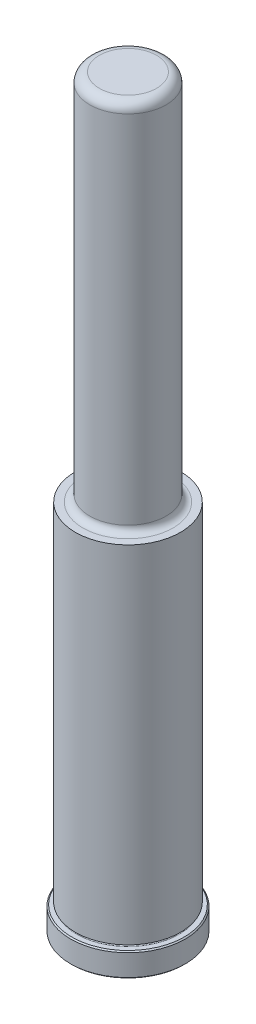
from build123d import *

# Parameters (mm, degrees)
CHAMFER1_SIZE = 0.381
FILLET7_R     = 3.175


with BuildPart() as part:
    # Sketch1 → Revolve1 (revolve)
    with BuildSketch(Plane(origin=(0, 0, 0), x_dir=(0, 0, -1), z_dir=(1, 0, 0)), mode=Mode.PRIVATE) as revolve1_sk:
        with BuildLine():
            Line((0, 0), (19.05, 0))
            Line((19.05, 0), (19.05, 7.9248))
            Line((19.05, 7.9248), (17.0688, 7.9248))
            ThreePointArc((17.0688, 7.9248), (16.6878, 8.3058), (17.0688, 8.6868))
            Line((17.0688, 8.6868), (17.4752, 8.6868))
            Line((17.4752, 8.6868), (17.4752, 123.825))
            Line((17.4752, 123.825), (14.9733, 123.825))
            ThreePointArc((14.9733, 123.825), (13.356853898, 124.494553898), (12.6873, 126.111))
            Line((12.6873, 126.111), (12.6873, 247.65))
            Line((12.6873, 247.65), (0, 247.65))
            Line((0, 247.65), (0, 0))
        make_face()
    revolve(revolve1_sk.sketch.rotate(Axis((0, 0, 0), (0, -1, 0)), 180), axis=Axis((0, 0, 0), (0, -1, 0)))

    # Chamfer1
    chamfer1_edges = [part.edges().sort_by_distance(p)[0] for p in [
        (0, 7.9248, -19.05),
        (0, 0, -19.05),
    ]]
    chamfer(chamfer1_edges, length=CHAMFER1_SIZE)

    # Fillet7
    fillet7_edges = [part.edges().sort_by_distance(p)[0] for p in [
        (0, 247.65, -12.6873),
    ]]
    fillet(fillet7_edges, radius=FILLET7_R)


solid = part.part
